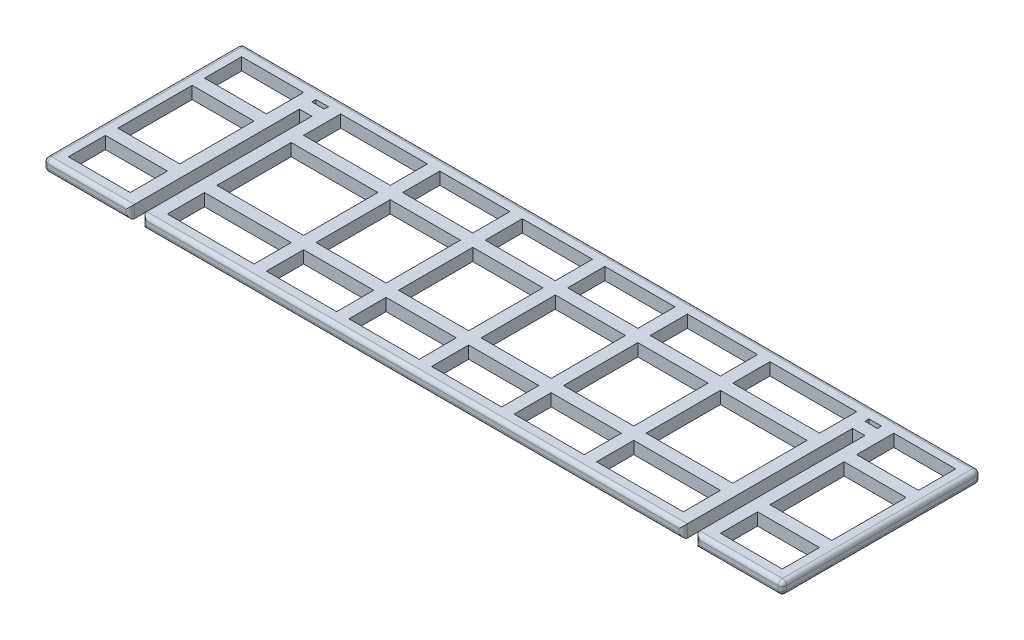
from build123d import *

# Parameters (mm, degrees)
SKETCH1_W               = 76.2
SKETCH1_H               = 4.7625
BOSS_EXTRUDE1_DEPTH     = 284.1625
CUT_EXTRUDE1_DEPTH      = 295.24045917
CUT_EXTRUDE1_DEPTH_BACK = 295.24045917
SKETCH2_W               = 274.6375
SKETCH2_H               = 66.675
SKETCH3_W               = 4.7625
SKETCH3_H               = 4.7625
BOSS_EXTRUDE2_DEPTH     = 65.0875
SKETCH5_W               = 4.7625
SKETCH5_H               = 4.7625
BOSS_EXTRUDE3_DEPTH     = 4.7625
SKETCH8_W               = 4.7625
SKETCH8_H               = 4.7625
BOSS_EXTRUDE4_DEPTH     = 1.5875
SKETCH9_W               = 4.7625
SKETCH9_H               = 4.7625
CUT_EXTRUDE2_DEPTH      = 4.7625
BOSS_EXTRUDE5_REACH     = 255.091
SKETCH10_W              = 4.7625
SKETCH10_H              = 4.7625
BOSS_EXTRUDE6_REACH     = 295.043
SKETCH11_W              = 4.7625
SKETCH11_H              = 4.7625
SKETCH12_W              = 4.7625
SKETCH12_H              = 4.7625
BOSS_EXTRUDE7_DEPTH     = 23.8125
SKETCH13_W              = 4.7625
SKETCH13_H              = 4.7625
BOSS_EXTRUDE8_DEPTH     = 23.8125
FILLET1_R               = 1.5875


with BuildPart() as part:
    # Sketch1 → Boss-Extrude1 (new body)
    with BuildSketch(Plane(origin=(0, 0, 0), x_dir=(0, 0, -1), z_dir=(1, 0, 0))):
        with Locations((38.1, 2.38125)):
            Rectangle(SKETCH1_W, SKETCH1_H)
    extrude(amount=BOSS_EXTRUDE1_DEPTH)

    # Sketch2 → Cut-Extrude1 (cut, two sides: drawn at the far end of the back side and taken through both)
    with BuildSketch(Plane(origin=(0, 4.7625, 0), x_dir=(1, 0, 0), z_dir=(0, 1, 0)).offset(-CUT_EXTRUDE1_DEPTH_BACK)):
        with Locations((142.08125, 38.1)):
            Rectangle(SKETCH2_W, SKETCH2_H)
    extrude(amount=CUT_EXTRUDE1_DEPTH + CUT_EXTRUDE1_DEPTH_BACK, mode=Mode.SUBTRACT)

    # Sketch3 → Boss-Extrude2 (add)
    with BuildSketch(Plane(origin=(0, 0, -4.7625), x_dir=(-1, 0, 0), z_dir=(0, 0, -1))):
        with Locations((-40.48125, 2.38125)):
            Rectangle(SKETCH3_W, SKETCH3_H)
        with Locations((-30.95625, 2.38125)):
            Rectangle(SKETCH3_W, SKETCH3_H)
    boss_extrude2 = extrude(amount=BOSS_EXTRUDE2_DEPTH)

    # Sketch5 → Boss-Extrude3 (add)
    with BuildSketch(Plane(origin=(33.3375, 0, 0), x_dir=(0, 0, -1), z_dir=(1, 0, 0))):
        with Locations((67.46875, 2.38125)):
            Rectangle(SKETCH5_W, SKETCH5_H)
    boss_extrude3 = extrude(amount=BOSS_EXTRUDE3_DEPTH)

    # Sketch8 → Boss-Extrude4 (add)
    with BuildSketch(Plane.XY.offset(-71.4375)):
        with Locations((30.95625, 2.38125)):
            Rectangle(SKETCH8_W, SKETCH8_H)
        with Locations((40.48125, 2.38125)):
            Rectangle(SKETCH8_W, SKETCH8_H)
    boss_extrude4 = extrude(amount=BOSS_EXTRUDE4_DEPTH)

    # Mirror1: Boss-Extrude2, Boss-Extrude3, Boss-Extrude4 across plane
    add(boss_extrude2.mirror(Plane.ZY.offset(-142.08125)))
    add(boss_extrude3.mirror(Plane.ZY.offset(-142.08125)))
    add(boss_extrude4.mirror(Plane.ZY.offset(-142.08125)))

    # Sketch9 → Cut-Extrude2 (cut)
    with BuildSketch(Plane.XY):
        with Locations((35.71875, 2.38125)):
            Rectangle(SKETCH9_W, SKETCH9_H)
        with Locations((248.44375, 2.38125)):
            Rectangle(SKETCH9_W, SKETCH9_H)
    extrude(amount=-CUT_EXTRUDE2_DEPTH, mode=Mode.SUBTRACT)

    # Sketch10 → Boss-Extrude5 (add, up to next)
    with BuildSketch(Plane(origin=(42.8625, 0, 0), x_dir=(0, 0, -1), z_dir=(1, 0, 0)), mode=Mode.PRIVATE) as boss_extrude5_sk1:
        with Locations((21.43125, 2.38125)):
            Rectangle(SKETCH10_W, SKETCH10_H)
    boss_extrude5_tool1 = extrude(boss_extrude5_sk1.sketch, amount=BOSS_EXTRUDE5_REACH, mode=Mode.PRIVATE) - part.part
    # Sketch10 → Boss-Extrude5 (add, up to next)
    with BuildSketch(Plane(origin=(42.8625, 0, 0), x_dir=(0, 0, -1), z_dir=(1, 0, 0)), mode=Mode.PRIVATE) as boss_extrude5_sk2:
        with Locations((54.76875, 2.38125)):
            Rectangle(SKETCH10_W, SKETCH10_H)
    boss_extrude5_tool2 = extrude(boss_extrude5_sk2.sketch, amount=BOSS_EXTRUDE5_REACH, mode=Mode.PRIVATE) - part.part
    add(boss_extrude5_tool1.solids().sort_by_distance((42.8625, 2.38125, -21.43125))[0])
    add(boss_extrude5_tool2.solids().sort_by_distance((42.8625, 2.38125, -54.76875))[0])

    # Boss-Extrude6: up to this face of the body (flat: up to its plane)
    boss_extrude6_end = Plane(part.part.faces().sort_by_distance((142.08125, 2.38125, -71.4375))[0])
    # Sketch11 → Boss-Extrude6 (add, up to the picked face)
    with BuildSketch(Plane(origin=(0, 0, -4.7625), x_dir=(-1, 0, 0), z_dir=(0, 0, -1)), mode=Mode.PRIVATE) as boss_extrude6_sk1:
        with Locations((-142.08125, 2.38125)):
            Rectangle(SKETCH11_W, SKETCH11_H)
    boss_extrude6_tool1 = split(extrude(boss_extrude6_sk1.sketch, amount=BOSS_EXTRUDE6_REACH, mode=Mode.PRIVATE), bisect_by=boss_extrude6_end, keep=Keep.BOTH, mode=Mode.PRIVATE)
    # Sketch11 → Boss-Extrude6 (add, up to the picked face)
    with BuildSketch(Plane(origin=(0, 0, -4.7625), x_dir=(-1, 0, 0), z_dir=(0, 0, -1)), mode=Mode.PRIVATE) as boss_extrude6_sk2:
        with Locations((-110.33125, 2.38125)):
            Rectangle(SKETCH11_W, SKETCH11_H)
    boss_extrude6_tool2 = split(extrude(boss_extrude6_sk2.sketch, amount=BOSS_EXTRUDE6_REACH, mode=Mode.PRIVATE), bisect_by=boss_extrude6_end, keep=Keep.BOTH, mode=Mode.PRIVATE)
    # Sketch11 → Boss-Extrude6 (add, up to the picked face)
    with BuildSketch(Plane(origin=(0, 0, -4.7625), x_dir=(-1, 0, 0), z_dir=(0, 0, -1)), mode=Mode.PRIVATE) as boss_extrude6_sk3:
        with Locations((-78.58125, 2.38125)):
            Rectangle(SKETCH11_W, SKETCH11_H)
    boss_extrude6_tool3 = split(extrude(boss_extrude6_sk3.sketch, amount=BOSS_EXTRUDE6_REACH, mode=Mode.PRIVATE), bisect_by=boss_extrude6_end, keep=Keep.BOTH, mode=Mode.PRIVATE)
    # Sketch11 → Boss-Extrude6 (add, up to the picked face)
    with BuildSketch(Plane(origin=(0, 0, -4.7625), x_dir=(-1, 0, 0), z_dir=(0, 0, -1)), mode=Mode.PRIVATE) as boss_extrude6_sk4:
        with Locations((-173.83125, 2.38125)):
            Rectangle(SKETCH11_W, SKETCH11_H)
    boss_extrude6_tool4 = split(extrude(boss_extrude6_sk4.sketch, amount=BOSS_EXTRUDE6_REACH, mode=Mode.PRIVATE), bisect_by=boss_extrude6_end, keep=Keep.BOTH, mode=Mode.PRIVATE)
    # Sketch11 → Boss-Extrude6 (add, up to the picked face)
    with BuildSketch(Plane(origin=(0, 0, -4.7625), x_dir=(-1, 0, 0), z_dir=(0, 0, -1)), mode=Mode.PRIVATE) as boss_extrude6_sk5:
        with Locations((-205.58125, 2.38125)):
            Rectangle(SKETCH11_W, SKETCH11_H)
    boss_extrude6_tool5 = split(extrude(boss_extrude6_sk5.sketch, amount=BOSS_EXTRUDE6_REACH, mode=Mode.PRIVATE), bisect_by=boss_extrude6_end, keep=Keep.BOTH, mode=Mode.PRIVATE)
    add(boss_extrude6_tool1.solids().sort_by(Axis((142.08125, 2.38125, -4.7625), (0, 0, -1)))[0])
    add(boss_extrude6_tool2.solids().sort_by(Axis((110.33125, 2.38125, -4.7625), (0, 0, -1)))[0])
    add(boss_extrude6_tool3.solids().sort_by(Axis((78.58125, 2.38125, -4.7625), (0, 0, -1)))[0])
    add(boss_extrude6_tool4.solids().sort_by(Axis((173.83125, 2.38125, -4.7625), (0, 0, -1)))[0])
    add(boss_extrude6_tool5.solids().sort_by(Axis((205.58125, 2.38125, -4.7625), (0, 0, -1)))[0])

    # Sketch12 → Boss-Extrude7 (add)
    with BuildSketch(Plane(origin=(255.5875, 0, 0), x_dir=(0, 0, -1), z_dir=(1, 0, 0))):
        with Locations((54.76875, 2.38125)):
            Rectangle(SKETCH12_W, SKETCH12_H)
        with Locations((21.43125, 2.38125)):
            Rectangle(SKETCH12_W, SKETCH12_H)
    extrude(amount=BOSS_EXTRUDE7_DEPTH)

    # Sketch13 → Boss-Extrude8 (add)
    with BuildSketch(Plane.ZY.offset(-28.575)):
        with Locations((-54.76875, 2.38125)):
            Rectangle(SKETCH13_W, SKETCH13_H)
        with Locations((-21.43125, 2.38125)):
            Rectangle(SKETCH13_W, SKETCH13_H)
    extrude(amount=BOSS_EXTRUDE8_DEPTH)

    # Fillet1
    fillet1_edges = [part.edges().sort_by_distance(p)[0] for p in [
        (284.1625, 4.7625, -38.1),
        (284.1625, 2.38125, 0),
        (142.08125, 0, 0),
        (16.66875, 0, 0),
        (142.08125, 4.7625, 0),
        (16.66875, 4.7625, 0),
        (38.1, 2.38125, 0),
        (33.3375, 2.38125, 0),
        (250.825, 2.38125, 0),
        (246.0625, 2.38125, 0),
        (284.1625, 0, -38.1),
        (0, 2.38125, 0),
        (0, 4.7625, -38.1),
        (0, 2.38125, -76.2),
        (0, 0, -38.1),
        (284.1625, 2.38125, -76.2),
        (267.49375, 0, 0),
        (267.49375, 4.7625, 0),
        (142.08125, 4.7625, -76.2),
        (142.08125, 0, -76.2),
    ]]
    fillet(fillet1_edges, radius=FILLET1_R)


solid = part.part
